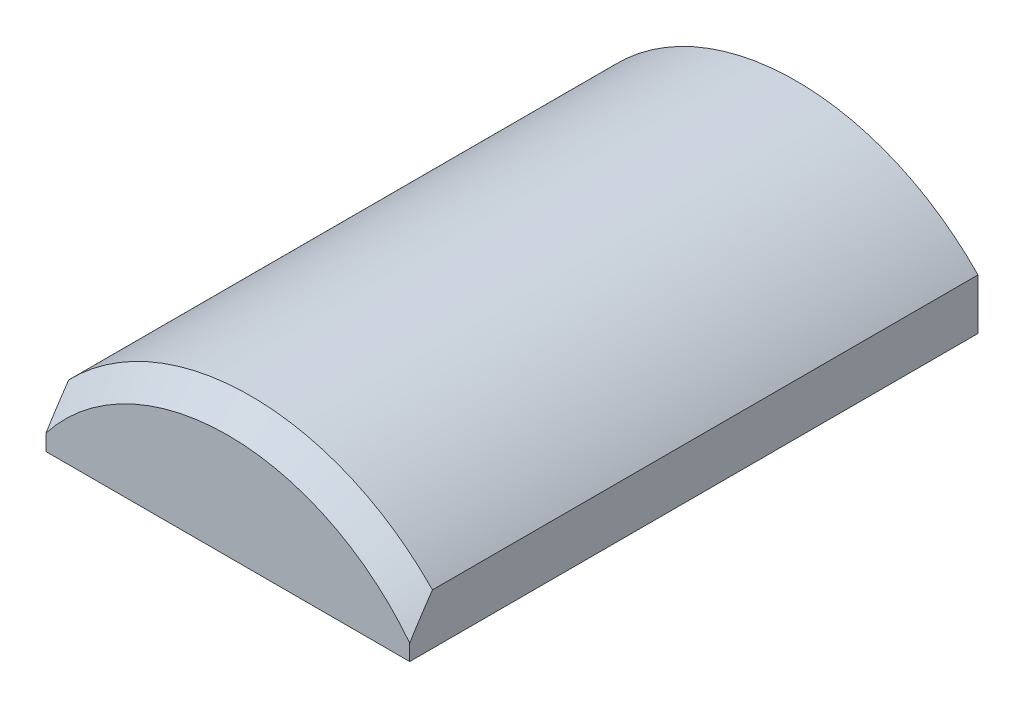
from build123d import *

# Parameters (mm, degrees)
BOSS_EXTRUDE1_DEPTH = 317.5
CHAMFER1_SIZE       = 12.7


with BuildPart() as part:
    # Sketch1 → Boss-Extrude1 (new body)
    with BuildSketch(Plane.XY):
        with BuildLine():
            Line((-101.6, 98.18145271), (-101.6, 69.85))
            Line((-101.6, 69.85), (101.6, 69.85))
            Line((101.6, 69.85), (101.6, 98.18145271))
            ThreePointArc((101.6, 98.18145271), (0, 141.2875), (-101.6, 98.18145271))
        make_face()
    extrude(amount=BOSS_EXTRUDE1_DEPTH)

    # Chamfer1
    chamfer1_edges = [part.edges().sort_by_distance(p)[0] for p in [
        (0, 141.2875, 317.5),
    ]]
    chamfer(chamfer1_edges, length=CHAMFER1_SIZE)


solid = part.part
